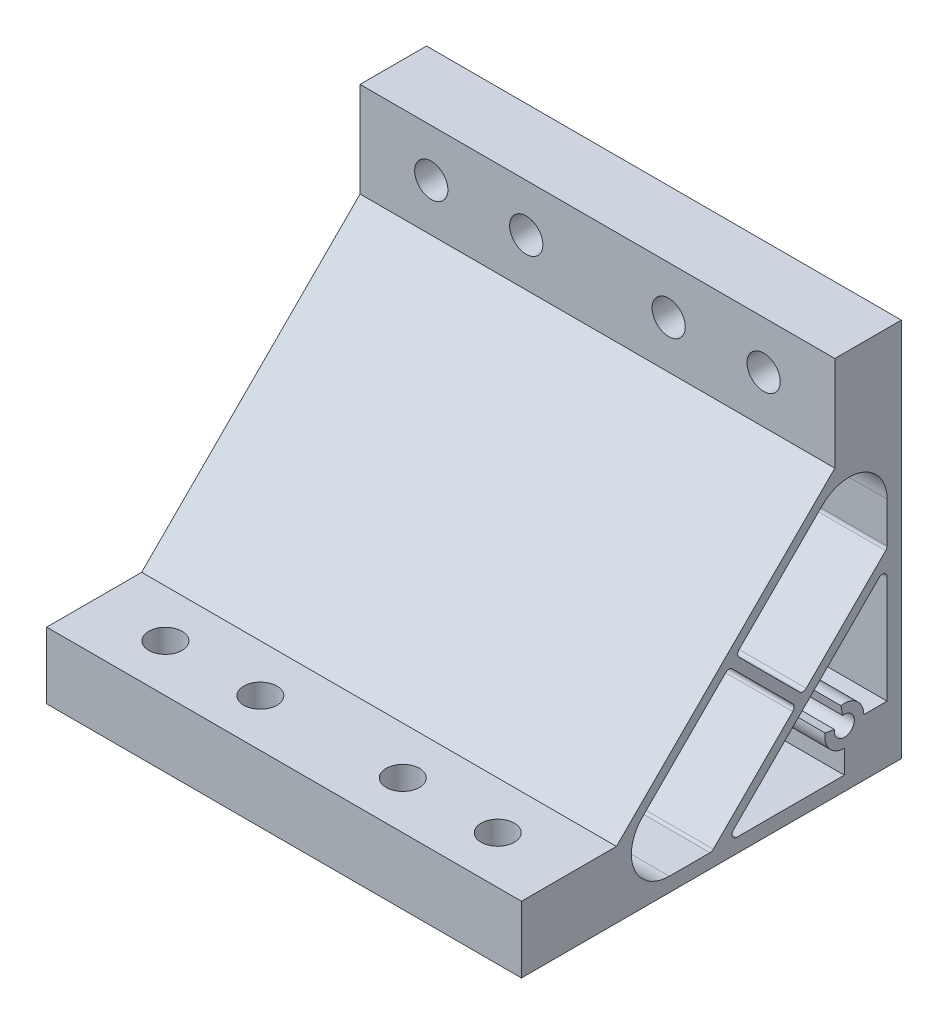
ISO-10303-21;
HEADER;
FILE_DESCRIPTION(('STEP AP214'),'2;1');
FILE_NAME('part.step','',(''),(''),'','','');
FILE_SCHEMA(('AUTOMOTIVE_DESIGN { 1 0 10303 214 1 1 1 1 }'));
ENDSEC;
DATA;
#1=APPLICATION_CONTEXT('core data for automotive mechanical design processes');
#2=APPLICATION_PROTOCOL_DEFINITION('international standard','automotive_design',2000,#1);
#3=PRODUCT_CONTEXT('',#1,'mechanical');
#4=PRODUCT('Part','Part','',(#3));
#5=PRODUCT_RELATED_PRODUCT_CATEGORY('part','',(#4));
#6=PRODUCT_DEFINITION_FORMATION('','',#4);
#7=PRODUCT_DEFINITION_CONTEXT('part definition',#1,'design');
#8=PRODUCT_DEFINITION('design','',#6,#7);
#9=PRODUCT_DEFINITION_SHAPE('','',#8);
#10=(LENGTH_UNIT() NAMED_UNIT(*) SI_UNIT(.MILLI.,.METRE.));
#11=(NAMED_UNIT(*) PLANE_ANGLE_UNIT() SI_UNIT($,.RADIAN.));
#12=(NAMED_UNIT(*) SI_UNIT($,.STERADIAN.) SOLID_ANGLE_UNIT());
#13=UNCERTAINTY_MEASURE_WITH_UNIT(LENGTH_MEASURE(1.E-05),#10,'distance_accuracy_value','');
#14=(GEOMETRIC_REPRESENTATION_CONTEXT(3) GLOBAL_UNCERTAINTY_ASSIGNED_CONTEXT((#13)) GLOBAL_UNIT_ASSIGNED_CONTEXT((#10,
#11,#12)) REPRESENTATION_CONTEXT('',''));
#15=CARTESIAN_POINT('',(0.,0.,0.));
#16=DIRECTION('',(0.,0.,1.));
#17=DIRECTION('',(1.,0.,0.));
#18=AXIS2_PLACEMENT_3D('',#15,#16,#17);
#19=CARTESIAN_POINT('',(50.,0.,0.));
#20=DIRECTION('',(1.,0.,0.));
#21=DIRECTION('',(0.,0.,-1.));
#22=AXIS2_PLACEMENT_3D('',#19,#20,#21);
#23=PLANE('',#22);
#24=DIRECTION('',(0.,0.,1.));
#25=VECTOR('',#24,1.);
#26=CARTESIAN_POINT('',(50.,14.,60.));
#27=LINE('',#26,#25);
#28=CARTESIAN_POINT('',(50.,14.,60.));
#29=VERTEX_POINT('',#28);
#30=CARTESIAN_POINT('',(50.,14.,80.));
#31=VERTEX_POINT('',#30);
#32=EDGE_CURVE('E475',#29,#31,#27,.T.);
#33=ORIENTED_EDGE('',*,*,#32,.T.);
#34=DIRECTION('',(0.,-1.,0.));
#35=VECTOR('',#34,1.);
#36=CARTESIAN_POINT('',(50.,14.,80.));
#37=LINE('',#36,#35);
#38=CARTESIAN_POINT('',(50.,0.,80.));
#39=VERTEX_POINT('',#38);
#40=EDGE_CURVE('E478',#31,#39,#37,.T.);
#41=ORIENTED_EDGE('',*,*,#40,.T.);
#42=DIRECTION('',(0.,0.,-1.));
#43=VECTOR('',#42,1.);
#44=CARTESIAN_POINT('',(50.,0.,80.));
#45=LINE('',#44,#43);
#46=CARTESIAN_POINT('',(50.,0.,0.));
#47=VERTEX_POINT('',#46);
#48=EDGE_CURVE('E480',#39,#47,#45,.T.);
#49=ORIENTED_EDGE('',*,*,#48,.T.);
#50=DIRECTION('',(0.,1.,0.));
#51=VECTOR('',#50,1.);
#52=CARTESIAN_POINT('',(50.,0.,0.));
#53=LINE('',#52,#51);
#54=CARTESIAN_POINT('',(50.,80.,0.));
#55=VERTEX_POINT('',#54);
#56=EDGE_CURVE('E482',#47,#55,#53,.T.);
#57=ORIENTED_EDGE('',*,*,#56,.T.);
#58=DIRECTION('',(0.,0.,1.));
#59=VECTOR('',#58,1.);
#60=CARTESIAN_POINT('',(50.,80.,0.));
#61=LINE('',#60,#59);
#62=CARTESIAN_POINT('',(50.,80.,14.));
#63=VERTEX_POINT('',#62);
#64=EDGE_CURVE('E484',#55,#63,#61,.T.);
#65=ORIENTED_EDGE('',*,*,#64,.T.);
#66=DIRECTION('',(0.,-1.,0.));
#67=VECTOR('',#66,1.);
#68=CARTESIAN_POINT('',(50.,80.,14.));
#69=LINE('',#68,#67);
#70=CARTESIAN_POINT('',(50.,60.,14.));
#71=VERTEX_POINT('',#70);
#72=EDGE_CURVE('E486',#63,#71,#69,.T.);
#73=ORIENTED_EDGE('',*,*,#72,.T.);
#74=DIRECTION('',(0.,-0.707106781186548,0.707106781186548));
#75=VECTOR('',#74,1.);
#76=CARTESIAN_POINT('',(50.,60.,14.));
#77=LINE('',#76,#75);
#78=EDGE_CURVE('E488',#71,#29,#77,.T.);
#79=ORIENTED_EDGE('',*,*,#78,.T.);
#80=EDGE_LOOP('',(#33,#41,#49,#57,#65,#73,#79));
#81=FACE_BOUND('',#80,.T.);
#82=DIRECTION('',(0.,-0.707106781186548,-0.707106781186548));
#83=VECTOR('',#82,1.);
#84=CARTESIAN_POINT('',(50.,35.585786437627,34.171572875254));
#85=LINE('',#84,#83);
#86=CARTESIAN_POINT('',(50.,35.585786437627,34.171572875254));
#87=VERTEX_POINT('',#86);
#88=CARTESIAN_POINT('',(50.,22.857864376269,21.443650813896));
#89=VERTEX_POINT('',#88);
#90=EDGE_CURVE('E444',#87,#89,#85,.T.);
#91=ORIENTED_EDGE('',*,*,#90,.F.);
#92=CARTESIAN_POINT('',(50.,36.2928932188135,33.464466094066));
#93=DIRECTION('',(1.,0.,0.));
#94=DIRECTION('',(0.,0.,-1.));
#95=AXIS2_PLACEMENT_3D('',#92,#93,#94);
#96=CIRCLE('',#95,1.00000000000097);
#97=CARTESIAN_POINT('',(50.,37.,34.171572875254));
#98=VERTEX_POINT('',#97);
#99=EDGE_CURVE('E442',#98,#87,#96,.T.);
#100=ORIENTED_EDGE('',*,*,#99,.F.);
#101=DIRECTION('',(0.,-0.707106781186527,0.707106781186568));
#102=VECTOR('',#101,1.);
#103=CARTESIAN_POINT('',(50.,54.514718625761,16.656854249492));
#104=LINE('',#103,#102);
#105=CARTESIAN_POINT('',(50.,54.514718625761,16.656854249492));
#106=VERTEX_POINT('',#105);
#107=EDGE_CURVE('E457',#106,#98,#104,.T.);
#108=ORIENTED_EDGE('',*,*,#107,.F.);
#109=CARTESIAN_POINT('',(50.,48.8578643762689,10.9999999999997));
#110=DIRECTION('',(1.,0.,0.));
#111=DIRECTION('',(0.,0.,-1.));
#112=AXIS2_PLACEMENT_3D('',#109,#110,#111);
#113=CIRCLE('',#112,7.99999999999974);
#114=CARTESIAN_POINT('',(50.,48.857864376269,3.));
#115=VERTEX_POINT('',#114);
#116=EDGE_CURVE('E454',#115,#106,#113,.T.);
#117=ORIENTED_EDGE('',*,*,#116,.F.);
#118=DIRECTION('',(0.,1.,0.));
#119=VECTOR('',#118,1.);
#120=CARTESIAN_POINT('',(50.,40.301515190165,3.));
#121=LINE('',#120,#119);
#122=CARTESIAN_POINT('',(50.,40.301515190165,3.));
#123=VERTEX_POINT('',#122);
#124=EDGE_CURVE('E452',#123,#115,#121,.T.);
#125=ORIENTED_EDGE('',*,*,#124,.F.);
#126=CARTESIAN_POINT('',(50.,40.3015151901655,4.00000000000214));
#127=DIRECTION('',(1.,0.,0.));
#128=DIRECTION('',(0.,0.,-1.));
#129=AXIS2_PLACEMENT_3D('',#126,#127,#128);
#130=CIRCLE('',#129,1.00000000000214);
#131=CARTESIAN_POINT('',(50.,39.594408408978,3.2928932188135));
#132=VERTEX_POINT('',#131);
#133=EDGE_CURVE('E450',#132,#123,#130,.T.);
#134=ORIENTED_EDGE('',*,*,#133,.F.);
#135=DIRECTION('',(0.,0.707106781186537,-0.707106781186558));
#136=VECTOR('',#135,1.);
#137=CARTESIAN_POINT('',(50.,22.857864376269,20.029437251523));
#138=LINE('',#137,#136);
#139=CARTESIAN_POINT('',(50.,22.857864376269,20.029437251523));
#140=VERTEX_POINT('',#139);
#141=EDGE_CURVE('E448',#140,#132,#138,.T.);
#142=ORIENTED_EDGE('',*,*,#141,.F.);
#143=CARTESIAN_POINT('',(50.,23.564971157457,20.7365440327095));
#144=DIRECTION('',(1.,0.,0.));
#145=DIRECTION('',(0.,0.,-1.));
#146=AXIS2_PLACEMENT_3D('',#143,#144,#145);
#147=CIRCLE('',#146,1.00000000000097);
#148=EDGE_CURVE('E446',#89,#140,#147,.T.);
#149=ORIENTED_EDGE('',*,*,#148,.F.);
#150=EDGE_LOOP('',(#91,#100,#108,#117,#125,#134,#142,#149));
#151=FACE_BOUND('',#150,.T.);
#152=DIRECTION('',(0.,0.,-1.));
#153=VECTOR('',#152,1.);
#154=CARTESIAN_POINT('',(50.,3.,34.644660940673));
#155=LINE('',#154,#153);
#156=CARTESIAN_POINT('',(50.,3.,34.644660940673));
#157=VERTEX_POINT('',#156);
#158=CARTESIAN_POINT('',(50.,3.,12.));
#159=VERTEX_POINT('',#158);
#160=EDGE_CURVE('E397',#157,#159,#155,.T.);
#161=ORIENTED_EDGE('',*,*,#160,.F.);
#162=CARTESIAN_POINT('',(50.,3.99999999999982,34.6446609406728));
#163=DIRECTION('',(1.,0.,0.));
#164=DIRECTION('',(0.,0.,-1.));
#165=AXIS2_PLACEMENT_3D('',#162,#163,#164);
#166=CIRCLE('',#165,0.999999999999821);
#167=CARTESIAN_POINT('',(50.,4.7071067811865,35.351767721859));
#168=VERTEX_POINT('',#167);
#169=EDGE_CURVE('E252',#168,#157,#166,.T.);
#170=ORIENTED_EDGE('',*,*,#169,.F.);
#171=DIRECTION('',(0.,-0.707106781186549,0.707106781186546));
#172=VECTOR('',#171,1.);
#173=CARTESIAN_POINT('',(50.,35.351767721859,4.7071067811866));
#174=LINE('',#173,#172);
#175=CARTESIAN_POINT('',(50.,35.351767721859,4.7071067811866));
#176=VERTEX_POINT('',#175);
#177=EDGE_CURVE('E417',#176,#168,#174,.T.);
#178=ORIENTED_EDGE('',*,*,#177,.F.);
#179=CARTESIAN_POINT('',(50.,34.6446609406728,3.99999999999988));
#180=DIRECTION('',(1.,0.,0.));
#181=DIRECTION('',(0.,0.,-1.));
#182=AXIS2_PLACEMENT_3D('',#179,#180,#181);
#183=CIRCLE('',#182,0.999999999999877);
#184=CARTESIAN_POINT('',(50.,34.644660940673,3.));
#185=VERTEX_POINT('',#184);
#186=EDGE_CURVE('E415',#185,#176,#183,.T.);
#187=ORIENTED_EDGE('',*,*,#186,.F.);
#188=DIRECTION('',(0.,1.,0.));
#189=VECTOR('',#188,1.);
#190=CARTESIAN_POINT('',(50.,12.,3.));
#191=LINE('',#190,#189);
#192=CARTESIAN_POINT('',(50.,12.,3.));
#193=VERTEX_POINT('',#192);
#194=EDGE_CURVE('E413',#193,#185,#191,.T.);
#195=ORIENTED_EDGE('',*,*,#194,.F.);
#196=DIRECTION('',(0.,0.,-1.));
#197=VECTOR('',#196,1.);
#198=CARTESIAN_POINT('',(50.,12.,7.9));
#199=LINE('',#198,#197);
#200=CARTESIAN_POINT('',(50.,12.,7.9));
#201=VERTEX_POINT('',#200);
#202=EDGE_CURVE('E411',#201,#193,#199,.T.);
#203=ORIENTED_EDGE('',*,*,#202,.F.);
#204=CARTESIAN_POINT('',(50.,11.9999999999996,12.0000000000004));
#205=DIRECTION('',(-1.,0.,0.));
#206=DIRECTION('',(0.,0.,1.));
#207=AXIS2_PLACEMENT_3D('',#204,#205,#206);
#208=CIRCLE('',#207,4.1000000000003);
#209=CARTESIAN_POINT('',(50.,16.0377117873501,12.711957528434));
#210=VERTEX_POINT('',#209);
#211=EDGE_CURVE('E409',#210,#201,#208,.T.);
#212=ORIENTED_EDGE('',*,*,#211,.F.);
#213=DIRECTION('',(0.,0.984807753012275,0.173648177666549));
#214=VECTOR('',#213,1.);
#215=CARTESIAN_POINT('',(50.,14.068096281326,12.364661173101));
#216=LINE('',#215,#214);
#217=CARTESIAN_POINT('',(50.,14.068096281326,12.364661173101));
#218=VERTEX_POINT('',#217);
#219=EDGE_CURVE('E407',#218,#210,#216,.T.);
#220=ORIENTED_EDGE('',*,*,#219,.F.);
#221=CARTESIAN_POINT('',(50.,11.9999999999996,12.0000000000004));
#222=DIRECTION('',(1.,0.,0.));
#223=DIRECTION('',(0.,0.,-1.));
#224=AXIS2_PLACEMENT_3D('',#221,#222,#223);
#225=CIRCLE('',#224,2.10000000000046);
#226=CARTESIAN_POINT('',(50.,12.3646611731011,14.0680962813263));
#227=VERTEX_POINT('',#226);
#228=EDGE_CURVE('E405',#227,#218,#225,.T.);
#229=ORIENTED_EDGE('',*,*,#228,.F.);
#230=DIRECTION('',(0.,-0.173648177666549,-0.984807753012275));
#231=VECTOR('',#230,1.);
#232=CARTESIAN_POINT('',(50.,12.711957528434,16.03771178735));
#233=LINE('',#232,#231);
#234=CARTESIAN_POINT('',(50.,12.711957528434,16.03771178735));
#235=VERTEX_POINT('',#234);
#236=EDGE_CURVE('E403',#235,#227,#233,.T.);
#237=ORIENTED_EDGE('',*,*,#236,.F.);
#238=CARTESIAN_POINT('',(50.,11.9999999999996,12.0000000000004));
#239=DIRECTION('',(-1.,0.,0.));
#240=DIRECTION('',(0.,0.,1.));
#241=AXIS2_PLACEMENT_3D('',#238,#239,#240);
#242=CIRCLE('',#241,4.09999999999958);
#243=CARTESIAN_POINT('',(50.,7.9,12.));
#244=VERTEX_POINT('',#243);
#245=EDGE_CURVE('E401',#244,#235,#242,.T.);
#246=ORIENTED_EDGE('',*,*,#245,.F.);
#247=DIRECTION('',(0.,1.,0.));
#248=VECTOR('',#247,1.);
#249=CARTESIAN_POINT('',(50.,3.,12.));
#250=LINE('',#249,#248);
#251=EDGE_CURVE('E399',#159,#244,#250,.T.);
#252=ORIENTED_EDGE('',*,*,#251,.F.);
#253=EDGE_LOOP('',(#161,#170,#178,#187,#195,#203,#212,#220,#229,#237,#246,#252));
#254=FACE_BOUND('',#253,.T.);
#255=DIRECTION('',(0.,0.,-1.));
#256=VECTOR('',#255,1.);
#257=CARTESIAN_POINT('',(50.,3.,48.857864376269));
#258=LINE('',#257,#256);
#259=CARTESIAN_POINT('',(50.,3.,48.857864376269));
#260=VERTEX_POINT('',#259);
#261=CARTESIAN_POINT('',(50.,3.,40.301515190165));
#262=VERTEX_POINT('',#261);
#263=EDGE_CURVE('E370',#260,#262,#258,.T.);
#264=ORIENTED_EDGE('',*,*,#263,.F.);
#265=CARTESIAN_POINT('',(50.,10.9999999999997,48.8578643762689));
#266=DIRECTION('',(1.,0.,0.));
#267=DIRECTION('',(0.,0.,-1.));
#268=AXIS2_PLACEMENT_3D('',#265,#266,#267);
#269=CIRCLE('',#268,7.99999999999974);
#270=CARTESIAN_POINT('',(50.,16.656854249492,54.514718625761));
#271=VERTEX_POINT('',#270);
#272=EDGE_CURVE('E249',#271,#260,#269,.T.);
#273=ORIENTED_EDGE('',*,*,#272,.F.);
#274=DIRECTION('',(0.,-0.707106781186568,0.707106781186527));
#275=VECTOR('',#274,1.);
#276=CARTESIAN_POINT('',(50.,34.171572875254,37.));
#277=LINE('',#276,#275);
#278=CARTESIAN_POINT('',(50.,34.171572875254,37.));
#279=VERTEX_POINT('',#278);
#280=EDGE_CURVE('E382',#279,#271,#277,.T.);
#281=ORIENTED_EDGE('',*,*,#280,.F.);
#282=CARTESIAN_POINT('',(50.,33.464466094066,36.2928932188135));
#283=DIRECTION('',(1.,0.,0.));
#284=DIRECTION('',(0.,0.,-1.));
#285=AXIS2_PLACEMENT_3D('',#282,#283,#284);
#286=CIRCLE('',#285,1.00000000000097);
#287=CARTESIAN_POINT('',(50.,34.171572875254,35.585786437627));
#288=VERTEX_POINT('',#287);
#289=EDGE_CURVE('E380',#288,#279,#286,.T.);
#290=ORIENTED_EDGE('',*,*,#289,.F.);
#291=DIRECTION('',(0.,0.707106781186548,0.707106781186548));
#292=VECTOR('',#291,1.);
#293=CARTESIAN_POINT('',(50.,21.443650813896,22.857864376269));
#294=LINE('',#293,#292);
#295=CARTESIAN_POINT('',(50.,21.443650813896,22.857864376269));
#296=VERTEX_POINT('',#295);
#297=EDGE_CURVE('E378',#296,#288,#294,.T.);
#298=ORIENTED_EDGE('',*,*,#297,.F.);
#299=CARTESIAN_POINT('',(50.,20.7365440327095,23.564971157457));
#300=DIRECTION('',(1.,0.,0.));
#301=DIRECTION('',(0.,0.,-1.));
#302=AXIS2_PLACEMENT_3D('',#299,#300,#301);
#303=CIRCLE('',#302,1.00000000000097);
#304=CARTESIAN_POINT('',(50.,20.029437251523,22.857864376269));
#305=VERTEX_POINT('',#304);
#306=EDGE_CURVE('E376',#305,#296,#303,.T.);
#307=ORIENTED_EDGE('',*,*,#306,.F.);
#308=DIRECTION('',(0.,0.707106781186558,-0.707106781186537));
#309=VECTOR('',#308,1.);
#310=CARTESIAN_POINT('',(50.,3.2928932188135,39.594408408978));
#311=LINE('',#310,#309);
#312=CARTESIAN_POINT('',(50.,3.2928932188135,39.594408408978));
#313=VERTEX_POINT('',#312);
#314=EDGE_CURVE('E374',#313,#305,#311,.T.);
#315=ORIENTED_EDGE('',*,*,#314,.F.);
#316=CARTESIAN_POINT('',(50.,4.00000000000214,40.3015151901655));
#317=DIRECTION('',(1.,0.,0.));
#318=DIRECTION('',(0.,0.,-1.));
#319=AXIS2_PLACEMENT_3D('',#316,#317,#318);
#320=CIRCLE('',#319,1.00000000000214);
#321=EDGE_CURVE('E372',#262,#313,#320,.T.);
#322=ORIENTED_EDGE('',*,*,#321,.F.);
#323=EDGE_LOOP('',(#264,#273,#281,#290,#298,#307,#315,#322));
#324=FACE_BOUND('',#323,.T.);
#325=ADVANCED_FACE('F15',(#81,#151,#254,#324),#23,.T.);
#326=CARTESIAN_POINT('',(50.,14.,60.));
#327=DIRECTION('',(0.,-1.,0.));
#328=DIRECTION('',(0.,0.,-1.));
#329=AXIS2_PLACEMENT_3D('',#326,#327,#328);
#330=PLANE('',#329);
#331=CARTESIAN_POINT('',(35.,14.,70.));
#332=DIRECTION('',(0.,1.,0.));
#333=DIRECTION('',(0.,0.,1.));
#334=AXIS2_PLACEMENT_3D('',#331,#332,#333);
#335=CIRCLE('',#334,3.5);
#336=CARTESIAN_POINT('',(35.,14.,73.5));
#337=VERTEX_POINT('',#336);
#338=EDGE_CURVE('E698',#337,#337,#335,.T.);
#339=ORIENTED_EDGE('',*,*,#338,.F.);
#340=EDGE_LOOP('',(#339));
#341=FACE_BOUND('',#340,.T.);
#342=CARTESIAN_POINT('',(15.,14.,70.));
#343=DIRECTION('',(0.,1.,0.));
#344=DIRECTION('',(0.,0.,1.));
#345=AXIS2_PLACEMENT_3D('',#342,#343,#344);
#346=CIRCLE('',#345,3.5);
#347=CARTESIAN_POINT('',(15.,14.,73.5));
#348=VERTEX_POINT('',#347);
#349=EDGE_CURVE('E702',#348,#348,#346,.T.);
#350=ORIENTED_EDGE('',*,*,#349,.F.);
#351=EDGE_LOOP('',(#350));
#352=FACE_BOUND('',#351,.T.);
#353=CARTESIAN_POINT('',(-15.,14.,70.));
#354=DIRECTION('',(0.,1.,0.));
#355=DIRECTION('',(0.,0.,1.));
#356=AXIS2_PLACEMENT_3D('',#353,#354,#355);
#357=CIRCLE('',#356,3.5);
#358=CARTESIAN_POINT('',(-15.,14.,73.5));
#359=VERTEX_POINT('',#358);
#360=EDGE_CURVE('E706',#359,#359,#357,.T.);
#361=ORIENTED_EDGE('',*,*,#360,.F.);
#362=EDGE_LOOP('',(#361));
#363=FACE_BOUND('',#362,.T.);
#364=CARTESIAN_POINT('',(-35.,14.,70.));
#365=DIRECTION('',(0.,1.,0.));
#366=DIRECTION('',(0.,0.,1.));
#367=AXIS2_PLACEMENT_3D('',#364,#365,#366);
#368=CIRCLE('',#367,3.5);
#369=CARTESIAN_POINT('',(-35.,14.,73.5));
#370=VERTEX_POINT('',#369);
#371=EDGE_CURVE('E268',#370,#370,#368,.T.);
#372=ORIENTED_EDGE('',*,*,#371,.F.);
#373=EDGE_LOOP('',(#372));
#374=FACE_BOUND('',#373,.T.);
#375=DIRECTION('',(-1.,0.,0.));
#376=VECTOR('',#375,1.);
#377=CARTESIAN_POINT('',(50.,14.,60.));
#378=LINE('',#377,#376);
#379=CARTESIAN_POINT('',(-50.,14.,60.));
#380=VERTEX_POINT('',#379);
#381=EDGE_CURVE('E490',#29,#380,#378,.T.);
#382=ORIENTED_EDGE('',*,*,#381,.T.);
#383=DIRECTION('',(0.,0.,1.));
#384=VECTOR('',#383,1.);
#385=CARTESIAN_POINT('',(-50.,14.,60.));
#386=LINE('',#385,#384);
#387=CARTESIAN_POINT('',(-50.,14.,80.));
#388=VERTEX_POINT('',#387);
#389=EDGE_CURVE('E348',#380,#388,#386,.T.);
#390=ORIENTED_EDGE('',*,*,#389,.T.);
#391=DIRECTION('',(-1.,0.,0.));
#392=VECTOR('',#391,1.);
#393=CARTESIAN_POINT('',(50.,14.,80.));
#394=LINE('',#393,#392);
#395=EDGE_CURVE('E9',#31,#388,#394,.T.);
#396=ORIENTED_EDGE('',*,*,#395,.F.);
#397=ORIENTED_EDGE('',*,*,#32,.F.);
#398=EDGE_LOOP('',(#382,#390,#396,#397));
#399=FACE_BOUND('',#398,.T.);
#400=ADVANCED_FACE('F17',(#341,#352,#363,#374,#399),#330,.F.);
#401=CARTESIAN_POINT('',(50.,14.,80.));
#402=DIRECTION('',(0.,0.,-1.));
#403=DIRECTION('',(-1.,0.,0.));
#404=AXIS2_PLACEMENT_3D('',#401,#402,#403);
#405=PLANE('',#404);
#406=ORIENTED_EDGE('',*,*,#395,.T.);
#407=DIRECTION('',(0.,-1.,0.));
#408=VECTOR('',#407,1.);
#409=CARTESIAN_POINT('',(-50.,14.,80.));
#410=LINE('',#409,#408);
#411=CARTESIAN_POINT('',(-50.,0.,80.));
#412=VERTEX_POINT('',#411);
#413=EDGE_CURVE('E351',#388,#412,#410,.T.);
#414=ORIENTED_EDGE('',*,*,#413,.T.);
#415=DIRECTION('',(-1.,0.,0.));
#416=VECTOR('',#415,1.);
#417=CARTESIAN_POINT('',(50.,0.,80.));
#418=LINE('',#417,#416);
#419=EDGE_CURVE('E23',#39,#412,#418,.T.);
#420=ORIENTED_EDGE('',*,*,#419,.F.);
#421=ORIENTED_EDGE('',*,*,#40,.F.);
#422=EDGE_LOOP('',(#406,#414,#420,#421));
#423=FACE_BOUND('',#422,.T.);
#424=ADVANCED_FACE('F511',(#423),#405,.F.);
#425=CARTESIAN_POINT('',(50.,0.,80.));
#426=DIRECTION('',(0.,1.,0.));
#427=DIRECTION('',(0.,0.,1.));
#428=AXIS2_PLACEMENT_3D('',#425,#426,#427);
#429=PLANE('',#428);
#430=CARTESIAN_POINT('',(35.,0.,70.));
#431=DIRECTION('',(0.,1.,0.));
#432=DIRECTION('',(0.,0.,1.));
#433=AXIS2_PLACEMENT_3D('',#430,#431,#432);
#434=CIRCLE('',#433,3.5);
#435=CARTESIAN_POINT('',(35.,0.,73.5));
#436=VERTEX_POINT('',#435);
#437=EDGE_CURVE('E725',#436,#436,#434,.T.);
#438=ORIENTED_EDGE('',*,*,#437,.T.);
#439=EDGE_LOOP('',(#438));
#440=FACE_BOUND('',#439,.T.);
#441=CARTESIAN_POINT('',(15.,0.,70.));
#442=DIRECTION('',(0.,1.,0.));
#443=DIRECTION('',(0.,0.,1.));
#444=AXIS2_PLACEMENT_3D('',#441,#442,#443);
#445=CIRCLE('',#444,3.5);
#446=CARTESIAN_POINT('',(15.,0.,73.5));
#447=VERTEX_POINT('',#446);
#448=EDGE_CURVE('E721',#447,#447,#445,.T.);
#449=ORIENTED_EDGE('',*,*,#448,.T.);
#450=EDGE_LOOP('',(#449));
#451=FACE_BOUND('',#450,.T.);
#452=CARTESIAN_POINT('',(-15.,0.,70.));
#453=DIRECTION('',(0.,1.,0.));
#454=DIRECTION('',(0.,0.,1.));
#455=AXIS2_PLACEMENT_3D('',#452,#453,#454);
#456=CIRCLE('',#455,3.5);
#457=CARTESIAN_POINT('',(-15.,0.,73.5));
#458=VERTEX_POINT('',#457);
#459=EDGE_CURVE('E715',#458,#458,#456,.T.);
#460=ORIENTED_EDGE('',*,*,#459,.T.);
#461=EDGE_LOOP('',(#460));
#462=FACE_BOUND('',#461,.T.);
#463=CARTESIAN_POINT('',(-35.,0.,70.));
#464=DIRECTION('',(0.,1.,0.));
#465=DIRECTION('',(0.,0.,1.));
#466=AXIS2_PLACEMENT_3D('',#463,#464,#465);
#467=CIRCLE('',#466,3.5);
#468=CARTESIAN_POINT('',(-35.,0.,73.5));
#469=VERTEX_POINT('',#468);
#470=EDGE_CURVE('E271',#469,#469,#467,.T.);
#471=ORIENTED_EDGE('',*,*,#470,.T.);
#472=EDGE_LOOP('',(#471));
#473=FACE_BOUND('',#472,.T.);
#474=ORIENTED_EDGE('',*,*,#419,.T.);
#475=DIRECTION('',(0.,0.,-1.));
#476=VECTOR('',#475,1.);
#477=CARTESIAN_POINT('',(-50.,0.,80.));
#478=LINE('',#477,#476);
#479=CARTESIAN_POINT('',(-50.,0.,0.));
#480=VERTEX_POINT('',#479);
#481=EDGE_CURVE('E354',#412,#480,#478,.T.);
#482=ORIENTED_EDGE('',*,*,#481,.T.);
#483=DIRECTION('',(-1.,0.,0.));
#484=VECTOR('',#483,1.);
#485=CARTESIAN_POINT('',(50.,0.,0.));
#486=LINE('',#485,#484);
#487=EDGE_CURVE('E498',#47,#480,#486,.T.);
#488=ORIENTED_EDGE('',*,*,#487,.F.);
#489=ORIENTED_EDGE('',*,*,#48,.F.);
#490=EDGE_LOOP('',(#474,#482,#488,#489));
#491=FACE_BOUND('',#490,.T.);
#492=ADVANCED_FACE('F503',(#440,#451,#462,#473,#491),#429,.F.);
#493=CARTESIAN_POINT('',(50.,0.,0.));
#494=DIRECTION('',(0.,0.,1.));
#495=DIRECTION('',(1.,0.,0.));
#496=AXIS2_PLACEMENT_3D('',#493,#494,#495);
#497=PLANE('',#496);
#498=CARTESIAN_POINT('',(35.,70.,0.));
#499=DIRECTION('',(0.,0.,1.));
#500=DIRECTION('',(1.,0.,0.));
#501=AXIS2_PLACEMENT_3D('',#498,#499,#500);
#502=CIRCLE('',#501,3.5);
#503=CARTESIAN_POINT('',(38.5,70.,0.));
#504=VERTEX_POINT('',#503);
#505=EDGE_CURVE('E748',#504,#504,#502,.T.);
#506=ORIENTED_EDGE('',*,*,#505,.T.);
#507=EDGE_LOOP('',(#506));
#508=FACE_BOUND('',#507,.T.);
#509=CARTESIAN_POINT('',(15.,70.,0.));
#510=DIRECTION('',(0.,0.,1.));
#511=DIRECTION('',(1.,0.,0.));
#512=AXIS2_PLACEMENT_3D('',#509,#510,#511);
#513=CIRCLE('',#512,3.5);
#514=CARTESIAN_POINT('',(18.5,70.,0.));
#515=VERTEX_POINT('',#514);
#516=EDGE_CURVE('E742',#515,#515,#513,.T.);
#517=ORIENTED_EDGE('',*,*,#516,.T.);
#518=EDGE_LOOP('',(#517));
#519=FACE_BOUND('',#518,.T.);
#520=CARTESIAN_POINT('',(-15.,70.,0.));
#521=DIRECTION('',(0.,0.,1.));
#522=DIRECTION('',(1.,0.,0.));
#523=AXIS2_PLACEMENT_3D('',#520,#521,#522);
#524=CIRCLE('',#523,3.5);
#525=CARTESIAN_POINT('',(-11.5,70.,0.));
#526=VERTEX_POINT('',#525);
#527=EDGE_CURVE('E736',#526,#526,#524,.T.);
#528=ORIENTED_EDGE('',*,*,#527,.T.);
#529=EDGE_LOOP('',(#528));
#530=FACE_BOUND('',#529,.T.);
#531=CARTESIAN_POINT('',(-35.,70.,0.));
#532=DIRECTION('',(0.,0.,1.));
#533=DIRECTION('',(1.,0.,0.));
#534=AXIS2_PLACEMENT_3D('',#531,#532,#533);
#535=CIRCLE('',#534,3.5);
#536=CARTESIAN_POINT('',(-31.5,70.,0.));
#537=VERTEX_POINT('',#536);
#538=EDGE_CURVE('E730',#537,#537,#535,.T.);
#539=ORIENTED_EDGE('',*,*,#538,.T.);
#540=EDGE_LOOP('',(#539));
#541=FACE_BOUND('',#540,.T.);
#542=ORIENTED_EDGE('',*,*,#487,.T.);
#543=DIRECTION('',(0.,1.,0.));
#544=VECTOR('',#543,1.);
#545=CARTESIAN_POINT('',(-50.,0.,0.));
#546=LINE('',#545,#544);
#547=CARTESIAN_POINT('',(-50.,80.,0.));
#548=VERTEX_POINT('',#547);
#549=EDGE_CURVE('E357',#480,#548,#546,.T.);
#550=ORIENTED_EDGE('',*,*,#549,.T.);
#551=DIRECTION('',(-1.,0.,0.));
#552=VECTOR('',#551,1.);
#553=CARTESIAN_POINT('',(50.,80.,0.));
#554=LINE('',#553,#552);
#555=EDGE_CURVE('E496',#55,#548,#554,.T.);
#556=ORIENTED_EDGE('',*,*,#555,.F.);
#557=ORIENTED_EDGE('',*,*,#56,.F.);
#558=EDGE_LOOP('',(#542,#550,#556,#557));
#559=FACE_BOUND('',#558,.T.);
#560=ADVANCED_FACE('F532',(#508,#519,#530,#541,#559),#497,.F.);
#561=CARTESIAN_POINT('',(50.,80.,0.));
#562=DIRECTION('',(0.,-1.,0.));
#563=DIRECTION('',(0.,0.,-1.));
#564=AXIS2_PLACEMENT_3D('',#561,#562,#563);
#565=PLANE('',#564);
#566=ORIENTED_EDGE('',*,*,#555,.T.);
#567=DIRECTION('',(0.,0.,1.));
#568=VECTOR('',#567,1.);
#569=CARTESIAN_POINT('',(-50.,80.,0.));
#570=LINE('',#569,#568);
#571=CARTESIAN_POINT('',(-50.,80.,14.));
#572=VERTEX_POINT('',#571);
#573=EDGE_CURVE('E360',#548,#572,#570,.T.);
#574=ORIENTED_EDGE('',*,*,#573,.T.);
#575=DIRECTION('',(-1.,0.,0.));
#576=VECTOR('',#575,1.);
#577=CARTESIAN_POINT('',(50.,80.,14.));
#578=LINE('',#577,#576);
#579=EDGE_CURVE('E494',#63,#572,#578,.T.);
#580=ORIENTED_EDGE('',*,*,#579,.F.);
#581=ORIENTED_EDGE('',*,*,#64,.F.);
#582=EDGE_LOOP('',(#566,#574,#580,#581));
#583=FACE_BOUND('',#582,.T.);
#584=ADVANCED_FACE('F527',(#583),#565,.F.);
#585=CARTESIAN_POINT('',(50.,80.,14.));
#586=DIRECTION('',(0.,0.,-1.));
#587=DIRECTION('',(-1.,0.,0.));
#588=AXIS2_PLACEMENT_3D('',#585,#586,#587);
#589=PLANE('',#588);
#590=CARTESIAN_POINT('',(35.,70.,14.));
#591=DIRECTION('',(0.,0.,1.));
#592=DIRECTION('',(1.,0.,0.));
#593=AXIS2_PLACEMENT_3D('',#590,#591,#592);
#594=CIRCLE('',#593,3.5);
#595=CARTESIAN_POINT('',(38.5,70.,14.));
#596=VERTEX_POINT('',#595);
#597=EDGE_CURVE('E745',#596,#596,#594,.T.);
#598=ORIENTED_EDGE('',*,*,#597,.F.);
#599=EDGE_LOOP('',(#598));
#600=FACE_BOUND('',#599,.T.);
#601=CARTESIAN_POINT('',(15.,70.,14.));
#602=DIRECTION('',(0.,0.,1.));
#603=DIRECTION('',(1.,0.,0.));
#604=AXIS2_PLACEMENT_3D('',#601,#602,#603);
#605=CIRCLE('',#604,3.5);
#606=CARTESIAN_POINT('',(18.5,70.,14.));
#607=VERTEX_POINT('',#606);
#608=EDGE_CURVE('E739',#607,#607,#605,.T.);
#609=ORIENTED_EDGE('',*,*,#608,.F.);
#610=EDGE_LOOP('',(#609));
#611=FACE_BOUND('',#610,.T.);
#612=CARTESIAN_POINT('',(-15.,70.,14.));
#613=DIRECTION('',(0.,0.,1.));
#614=DIRECTION('',(1.,0.,0.));
#615=AXIS2_PLACEMENT_3D('',#612,#613,#614);
#616=CIRCLE('',#615,3.5);
#617=CARTESIAN_POINT('',(-11.5,70.,14.));
#618=VERTEX_POINT('',#617);
#619=EDGE_CURVE('E733',#618,#618,#616,.T.);
#620=ORIENTED_EDGE('',*,*,#619,.F.);
#621=EDGE_LOOP('',(#620));
#622=FACE_BOUND('',#621,.T.);
#623=CARTESIAN_POINT('',(-35.,70.,14.));
#624=DIRECTION('',(0.,0.,1.));
#625=DIRECTION('',(1.,0.,0.));
#626=AXIS2_PLACEMENT_3D('',#623,#624,#625);
#627=CIRCLE('',#626,3.5);
#628=CARTESIAN_POINT('',(-31.5,70.,14.));
#629=VERTEX_POINT('',#628);
#630=EDGE_CURVE('E728',#629,#629,#627,.T.);
#631=ORIENTED_EDGE('',*,*,#630,.F.);
#632=EDGE_LOOP('',(#631));
#633=FACE_BOUND('',#632,.T.);
#634=ORIENTED_EDGE('',*,*,#579,.T.);
#635=DIRECTION('',(0.,-1.,0.));
#636=VECTOR('',#635,1.);
#637=CARTESIAN_POINT('',(-50.,80.,14.));
#638=LINE('',#637,#636);
#639=CARTESIAN_POINT('',(-50.,60.,14.));
#640=VERTEX_POINT('',#639);
#641=EDGE_CURVE('E363',#572,#640,#638,.T.);
#642=ORIENTED_EDGE('',*,*,#641,.T.);
#643=DIRECTION('',(-1.,0.,0.));
#644=VECTOR('',#643,1.);
#645=CARTESIAN_POINT('',(50.,60.,14.));
#646=LINE('',#645,#644);
#647=EDGE_CURVE('E492',#71,#640,#646,.T.);
#648=ORIENTED_EDGE('',*,*,#647,.F.);
#649=ORIENTED_EDGE('',*,*,#72,.F.);
#650=EDGE_LOOP('',(#634,#642,#648,#649));
#651=FACE_BOUND('',#650,.T.);
#652=ADVANCED_FACE('F524',(#600,#611,#622,#633,#651),#589,.F.);
#653=CARTESIAN_POINT('',(50.,60.,14.));
#654=DIRECTION('',(0.,-0.707106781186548,-0.707106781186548));
#655=DIRECTION('',(0.,0.707106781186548,-0.707106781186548));
#656=AXIS2_PLACEMENT_3D('',#653,#654,#655);
#657=PLANE('',#656);
#658=ORIENTED_EDGE('',*,*,#647,.T.);
#659=DIRECTION('',(0.,-0.707106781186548,0.707106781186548));
#660=VECTOR('',#659,1.);
#661=CARTESIAN_POINT('',(-50.,60.,14.));
#662=LINE('',#661,#660);
#663=EDGE_CURVE('E366',#640,#380,#662,.T.);
#664=ORIENTED_EDGE('',*,*,#663,.T.);
#665=ORIENTED_EDGE('',*,*,#381,.F.);
#666=ORIENTED_EDGE('',*,*,#78,.F.);
#667=EDGE_LOOP('',(#658,#664,#665,#666));
#668=FACE_BOUND('',#667,.T.);
#669=ADVANCED_FACE('F519',(#668),#657,.F.);
#670=CARTESIAN_POINT('',(50.,36.2928932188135,33.464466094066));
#671=DIRECTION('',(-1.,0.,0.));
#672=DIRECTION('',(0.,0.,1.));
#673=AXIS2_PLACEMENT_3D('',#670,#671,#672);
#674=CYLINDRICAL_SURFACE('',#673,1.00000000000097);
#675=DIRECTION('',(-1.,0.,0.));
#676=VECTOR('',#675,1.);
#677=CARTESIAN_POINT('',(50.,35.585786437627,34.171572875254));
#678=LINE('',#677,#676);
#679=CARTESIAN_POINT('',(-50.,35.585786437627,34.171572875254));
#680=VERTEX_POINT('',#679);
#681=EDGE_CURVE('E473',#87,#680,#678,.T.);
#682=ORIENTED_EDGE('',*,*,#681,.T.);
#683=CARTESIAN_POINT('',(-50.,36.2928932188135,33.464466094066));
#684=DIRECTION('',(1.,0.,0.));
#685=DIRECTION('',(0.,0.,-1.));
#686=AXIS2_PLACEMENT_3D('',#683,#684,#685);
#687=CIRCLE('',#686,1.00000000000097);
#688=CARTESIAN_POINT('',(-50.,37.,34.171572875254));
#689=VERTEX_POINT('',#688);
#690=EDGE_CURVE('E324',#689,#680,#687,.T.);
#691=ORIENTED_EDGE('',*,*,#690,.F.);
#692=DIRECTION('',(-1.,0.,0.));
#693=VECTOR('',#692,1.);
#694=CARTESIAN_POINT('',(50.,37.,34.171572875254));
#695=LINE('',#694,#693);
#696=EDGE_CURVE('E459',#98,#689,#695,.T.);
#697=ORIENTED_EDGE('',*,*,#696,.F.);
#698=ORIENTED_EDGE('',*,*,#99,.T.);
#699=EDGE_LOOP('',(#682,#691,#697,#698));
#700=FACE_BOUND('',#699,.T.);
#701=ADVANCED_FACE('F669',(#700),#674,.F.);
#702=CARTESIAN_POINT('',(50.,35.585786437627,34.171572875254));
#703=DIRECTION('',(0.,0.707106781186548,-0.707106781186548));
#704=DIRECTION('',(0.,0.707106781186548,0.707106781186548));
#705=AXIS2_PLACEMENT_3D('',#702,#703,#704);
#706=PLANE('',#705);
#707=DIRECTION('',(-1.,0.,0.));
#708=VECTOR('',#707,1.);
#709=CARTESIAN_POINT('',(50.,22.857864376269,21.443650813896));
#710=LINE('',#709,#708);
#711=CARTESIAN_POINT('',(-50.,22.857864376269,21.443650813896));
#712=VERTEX_POINT('',#711);
#713=EDGE_CURVE('E471',#89,#712,#710,.T.);
#714=ORIENTED_EDGE('',*,*,#713,.T.);
#715=DIRECTION('',(0.,-0.707106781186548,-0.707106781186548));
#716=VECTOR('',#715,1.);
#717=CARTESIAN_POINT('',(-50.,35.585786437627,34.171572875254));
#718=LINE('',#717,#716);
#719=EDGE_CURVE('E327',#680,#712,#718,.T.);
#720=ORIENTED_EDGE('',*,*,#719,.F.);
#721=ORIENTED_EDGE('',*,*,#681,.F.);
#722=ORIENTED_EDGE('',*,*,#90,.T.);
#723=EDGE_LOOP('',(#714,#720,#721,#722));
#724=FACE_BOUND('',#723,.T.);
#725=ADVANCED_FACE('F665',(#724),#706,.T.);
#726=CARTESIAN_POINT('',(50.,23.564971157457,20.7365440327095));
#727=DIRECTION('',(-1.,0.,0.));
#728=DIRECTION('',(0.,0.,1.));
#729=AXIS2_PLACEMENT_3D('',#726,#727,#728);
#730=CYLINDRICAL_SURFACE('',#729,1.00000000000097);
#731=DIRECTION('',(-1.,0.,0.));
#732=VECTOR('',#731,1.);
#733=CARTESIAN_POINT('',(50.,22.857864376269,20.029437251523));
#734=LINE('',#733,#732);
#735=CARTESIAN_POINT('',(-50.,22.857864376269,20.029437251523));
#736=VERTEX_POINT('',#735);
#737=EDGE_CURVE('E469',#140,#736,#734,.T.);
#738=ORIENTED_EDGE('',*,*,#737,.T.);
#739=CARTESIAN_POINT('',(-50.,23.564971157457,20.7365440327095));
#740=DIRECTION('',(1.,0.,0.));
#741=DIRECTION('',(0.,0.,-1.));
#742=AXIS2_PLACEMENT_3D('',#739,#740,#741);
#743=CIRCLE('',#742,1.00000000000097);
#744=EDGE_CURVE('E330',#712,#736,#743,.T.);
#745=ORIENTED_EDGE('',*,*,#744,.F.);
#746=ORIENTED_EDGE('',*,*,#713,.F.);
#747=ORIENTED_EDGE('',*,*,#148,.T.);
#748=EDGE_LOOP('',(#738,#745,#746,#747));
#749=FACE_BOUND('',#748,.T.);
#750=ADVANCED_FACE('F661',(#749),#730,.F.);
#751=CARTESIAN_POINT('',(50.,22.857864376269,20.029437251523));
#752=DIRECTION('',(0.,0.707106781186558,0.707106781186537));
#753=DIRECTION('',(0.,-0.707106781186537,0.707106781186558));
#754=AXIS2_PLACEMENT_3D('',#751,#752,#753);
#755=PLANE('',#754);
#756=DIRECTION('',(-1.,0.,0.));
#757=VECTOR('',#756,1.);
#758=CARTESIAN_POINT('',(50.,39.594408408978,3.2928932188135));
#759=LINE('',#758,#757);
#760=CARTESIAN_POINT('',(-50.,39.594408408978,3.2928932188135));
#761=VERTEX_POINT('',#760);
#762=EDGE_CURVE('E467',#132,#761,#759,.T.);
#763=ORIENTED_EDGE('',*,*,#762,.T.);
#764=DIRECTION('',(0.,0.707106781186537,-0.707106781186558));
#765=VECTOR('',#764,1.);
#766=CARTESIAN_POINT('',(-50.,22.857864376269,20.029437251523));
#767=LINE('',#766,#765);
#768=EDGE_CURVE('E333',#736,#761,#767,.T.);
#769=ORIENTED_EDGE('',*,*,#768,.F.);
#770=ORIENTED_EDGE('',*,*,#737,.F.);
#771=ORIENTED_EDGE('',*,*,#141,.T.);
#772=EDGE_LOOP('',(#763,#769,#770,#771));
#773=FACE_BOUND('',#772,.T.);
#774=ADVANCED_FACE('F657',(#773),#755,.T.);
#775=CARTESIAN_POINT('',(50.,40.3015151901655,4.00000000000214));
#776=DIRECTION('',(-1.,0.,0.));
#777=DIRECTION('',(0.,0.,1.));
#778=AXIS2_PLACEMENT_3D('',#775,#776,#777);
#779=CYLINDRICAL_SURFACE('',#778,1.00000000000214);
#780=DIRECTION('',(-1.,0.,0.));
#781=VECTOR('',#780,1.);
#782=CARTESIAN_POINT('',(50.,40.301515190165,3.));
#783=LINE('',#782,#781);
#784=CARTESIAN_POINT('',(-50.,40.301515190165,3.));
#785=VERTEX_POINT('',#784);
#786=EDGE_CURVE('E465',#123,#785,#783,.T.);
#787=ORIENTED_EDGE('',*,*,#786,.T.);
#788=CARTESIAN_POINT('',(-50.,40.3015151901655,4.00000000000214));
#789=DIRECTION('',(1.,0.,0.));
#790=DIRECTION('',(0.,0.,-1.));
#791=AXIS2_PLACEMENT_3D('',#788,#789,#790);
#792=CIRCLE('',#791,1.00000000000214);
#793=EDGE_CURVE('E336',#761,#785,#792,.T.);
#794=ORIENTED_EDGE('',*,*,#793,.F.);
#795=ORIENTED_EDGE('',*,*,#762,.F.);
#796=ORIENTED_EDGE('',*,*,#133,.T.);
#797=EDGE_LOOP('',(#787,#794,#795,#796));
#798=FACE_BOUND('',#797,.T.);
#799=ADVANCED_FACE('F653',(#798),#779,.F.);
#800=CARTESIAN_POINT('',(50.,40.301515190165,3.));
#801=DIRECTION('',(0.,0.,1.));
#802=DIRECTION('',(1.,0.,0.));
#803=AXIS2_PLACEMENT_3D('',#800,#801,#802);
#804=PLANE('',#803);
#805=DIRECTION('',(-1.,0.,0.));
#806=VECTOR('',#805,1.);
#807=CARTESIAN_POINT('',(50.,48.857864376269,3.));
#808=LINE('',#807,#806);
#809=CARTESIAN_POINT('',(-50.,48.857864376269,3.));
#810=VERTEX_POINT('',#809);
#811=EDGE_CURVE('E463',#115,#810,#808,.T.);
#812=ORIENTED_EDGE('',*,*,#811,.T.);
#813=DIRECTION('',(0.,1.,0.));
#814=VECTOR('',#813,1.);
#815=CARTESIAN_POINT('',(-50.,40.301515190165,3.));
#816=LINE('',#815,#814);
#817=EDGE_CURVE('E339',#785,#810,#816,.T.);
#818=ORIENTED_EDGE('',*,*,#817,.F.);
#819=ORIENTED_EDGE('',*,*,#786,.F.);
#820=ORIENTED_EDGE('',*,*,#124,.T.);
#821=EDGE_LOOP('',(#812,#818,#819,#820));
#822=FACE_BOUND('',#821,.T.);
#823=ADVANCED_FACE('F649',(#822),#804,.T.);
#824=CARTESIAN_POINT('',(50.,48.8578643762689,10.9999999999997));
#825=DIRECTION('',(-1.,0.,0.));
#826=DIRECTION('',(0.,0.,1.));
#827=AXIS2_PLACEMENT_3D('',#824,#825,#826);
#828=CYLINDRICAL_SURFACE('',#827,7.99999999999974);
#829=DIRECTION('',(-1.,0.,0.));
#830=VECTOR('',#829,1.);
#831=CARTESIAN_POINT('',(50.,54.514718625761,16.656854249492));
#832=LINE('',#831,#830);
#833=CARTESIAN_POINT('',(-50.,54.514718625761,16.656854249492));
#834=VERTEX_POINT('',#833);
#835=EDGE_CURVE('E461',#106,#834,#832,.T.);
#836=ORIENTED_EDGE('',*,*,#835,.T.);
#837=CARTESIAN_POINT('',(-50.,48.8578643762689,10.9999999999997));
#838=DIRECTION('',(1.,0.,0.));
#839=DIRECTION('',(0.,0.,-1.));
#840=AXIS2_PLACEMENT_3D('',#837,#838,#839);
#841=CIRCLE('',#840,7.99999999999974);
#842=EDGE_CURVE('E342',#810,#834,#841,.T.);
#843=ORIENTED_EDGE('',*,*,#842,.F.);
#844=ORIENTED_EDGE('',*,*,#811,.F.);
#845=ORIENTED_EDGE('',*,*,#116,.T.);
#846=EDGE_LOOP('',(#836,#843,#844,#845));
#847=FACE_BOUND('',#846,.T.);
#848=ADVANCED_FACE('F645',(#847),#828,.F.);
#849=CARTESIAN_POINT('',(50.,54.514718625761,16.656854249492));
#850=DIRECTION('',(0.,-0.707106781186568,-0.707106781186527));
#851=DIRECTION('',(0.,0.707106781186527,-0.707106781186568));
#852=AXIS2_PLACEMENT_3D('',#849,#850,#851);
#853=PLANE('',#852);
#854=ORIENTED_EDGE('',*,*,#696,.T.);
#855=DIRECTION('',(0.,-0.707106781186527,0.707106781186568));
#856=VECTOR('',#855,1.);
#857=CARTESIAN_POINT('',(-50.,54.514718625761,16.656854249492));
#858=LINE('',#857,#856);
#859=EDGE_CURVE('E345',#834,#689,#858,.T.);
#860=ORIENTED_EDGE('',*,*,#859,.F.);
#861=ORIENTED_EDGE('',*,*,#835,.F.);
#862=ORIENTED_EDGE('',*,*,#107,.T.);
#863=EDGE_LOOP('',(#854,#860,#861,#862));
#864=FACE_BOUND('',#863,.T.);
#865=ADVANCED_FACE('F641',(#864),#853,.T.);
#866=CARTESIAN_POINT('',(50.,3.99999999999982,34.6446609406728));
#867=DIRECTION('',(-1.,0.,0.));
#868=DIRECTION('',(0.,0.,1.));
#869=AXIS2_PLACEMENT_3D('',#866,#867,#868);
#870=CYLINDRICAL_SURFACE('',#869,0.999999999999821);
#871=DIRECTION('',(-1.,0.,0.));
#872=VECTOR('',#871,1.);
#873=CARTESIAN_POINT('',(50.,3.,34.644660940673));
#874=LINE('',#873,#872);
#875=CARTESIAN_POINT('',(-50.,3.,34.644660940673));
#876=VERTEX_POINT('',#875);
#877=EDGE_CURVE('E440',#157,#876,#874,.T.);
#878=ORIENTED_EDGE('',*,*,#877,.T.);
#879=CARTESIAN_POINT('',(-50.,3.99999999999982,34.6446609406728));
#880=DIRECTION('',(1.,0.,0.));
#881=DIRECTION('',(0.,0.,-1.));
#882=AXIS2_PLACEMENT_3D('',#879,#880,#881);
#883=CIRCLE('',#882,0.999999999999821);
#884=CARTESIAN_POINT('',(-50.,4.7071067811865,35.351767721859));
#885=VERTEX_POINT('',#884);
#886=EDGE_CURVE('E288',#885,#876,#883,.T.);
#887=ORIENTED_EDGE('',*,*,#886,.F.);
#888=DIRECTION('',(-1.,0.,0.));
#889=VECTOR('',#888,1.);
#890=CARTESIAN_POINT('',(50.,4.7071067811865,35.351767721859));
#891=LINE('',#890,#889);
#892=EDGE_CURVE('E419',#168,#885,#891,.T.);
#893=ORIENTED_EDGE('',*,*,#892,.F.);
#894=ORIENTED_EDGE('',*,*,#169,.T.);
#895=EDGE_LOOP('',(#878,#887,#893,#894));
#896=FACE_BOUND('',#895,.T.);
#897=ADVANCED_FACE('F637',(#896),#870,.F.);
#898=CARTESIAN_POINT('',(50.,3.,34.644660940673));
#899=DIRECTION('',(0.,1.,0.));
#900=DIRECTION('',(0.,0.,1.));
#901=AXIS2_PLACEMENT_3D('',#898,#899,#900);
#902=PLANE('',#901);
#903=DIRECTION('',(-1.,0.,0.));
#904=VECTOR('',#903,1.);
#905=CARTESIAN_POINT('',(50.,3.,12.));
#906=LINE('',#905,#904);
#907=CARTESIAN_POINT('',(-50.,3.,12.));
#908=VERTEX_POINT('',#907);
#909=EDGE_CURVE('E438',#159,#908,#906,.T.);
#910=ORIENTED_EDGE('',*,*,#909,.T.);
#911=DIRECTION('',(0.,0.,-1.));
#912=VECTOR('',#911,1.);
#913=CARTESIAN_POINT('',(-50.,3.,34.644660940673));
#914=LINE('',#913,#912);
#915=EDGE_CURVE('E291',#876,#908,#914,.T.);
#916=ORIENTED_EDGE('',*,*,#915,.F.);
#917=ORIENTED_EDGE('',*,*,#877,.F.);
#918=ORIENTED_EDGE('',*,*,#160,.T.);
#919=EDGE_LOOP('',(#910,#916,#917,#918));
#920=FACE_BOUND('',#919,.T.);
#921=ADVANCED_FACE('F633',(#920),#902,.T.);
#922=CARTESIAN_POINT('',(50.,3.,12.));
#923=DIRECTION('',(0.,0.,1.));
#924=DIRECTION('',(1.,0.,0.));
#925=AXIS2_PLACEMENT_3D('',#922,#923,#924);
#926=PLANE('',#925);
#927=DIRECTION('',(-1.,0.,0.));
#928=VECTOR('',#927,1.);
#929=CARTESIAN_POINT('',(50.,7.9,12.));
#930=LINE('',#929,#928);
#931=CARTESIAN_POINT('',(-50.,7.9,12.));
#932=VERTEX_POINT('',#931);
#933=EDGE_CURVE('E436',#244,#932,#930,.T.);
#934=ORIENTED_EDGE('',*,*,#933,.T.);
#935=DIRECTION('',(0.,1.,0.));
#936=VECTOR('',#935,1.);
#937=CARTESIAN_POINT('',(-50.,3.,12.));
#938=LINE('',#937,#936);
#939=EDGE_CURVE('E294',#908,#932,#938,.T.);
#940=ORIENTED_EDGE('',*,*,#939,.F.);
#941=ORIENTED_EDGE('',*,*,#909,.F.);
#942=ORIENTED_EDGE('',*,*,#251,.T.);
#943=EDGE_LOOP('',(#934,#940,#941,#942));
#944=FACE_BOUND('',#943,.T.);
#945=ADVANCED_FACE('F629',(#944),#926,.T.);
#946=CARTESIAN_POINT('',(50.,11.9999999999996,12.0000000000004));
#947=DIRECTION('',(-1.,0.,0.));
#948=DIRECTION('',(0.,0.,1.));
#949=AXIS2_PLACEMENT_3D('',#946,#947,#948);
#950=CYLINDRICAL_SURFACE('',#949,4.09999999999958);
#951=DIRECTION('',(-1.,0.,0.));
#952=VECTOR('',#951,1.);
#953=CARTESIAN_POINT('',(50.,12.711957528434,16.03771178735));
#954=LINE('',#953,#952);
#955=CARTESIAN_POINT('',(-50.,12.711957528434,16.03771178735));
#956=VERTEX_POINT('',#955);
#957=EDGE_CURVE('E434',#235,#956,#954,.T.);
#958=ORIENTED_EDGE('',*,*,#957,.T.);
#959=CARTESIAN_POINT('',(-50.,11.9999999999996,12.0000000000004));
#960=DIRECTION('',(-1.,0.,0.));
#961=DIRECTION('',(0.,0.,1.));
#962=AXIS2_PLACEMENT_3D('',#959,#960,#961);
#963=CIRCLE('',#962,4.09999999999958);
#964=EDGE_CURVE('E297',#932,#956,#963,.T.);
#965=ORIENTED_EDGE('',*,*,#964,.F.);
#966=ORIENTED_EDGE('',*,*,#933,.F.);
#967=ORIENTED_EDGE('',*,*,#245,.T.);
#968=EDGE_LOOP('',(#958,#965,#966,#967));
#969=FACE_BOUND('',#968,.T.);
#970=ADVANCED_FACE('F625',(#969),#950,.T.);
#971=CARTESIAN_POINT('',(50.,12.711957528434,16.03771178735));
#972=DIRECTION('',(0.,0.984807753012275,-0.173648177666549));
#973=DIRECTION('',(0.,0.173648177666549,0.984807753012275));
#974=AXIS2_PLACEMENT_3D('',#971,#972,#973);
#975=PLANE('',#974);
#976=DIRECTION('',(-1.,0.,0.));
#977=VECTOR('',#976,1.);
#978=CARTESIAN_POINT('',(50.,12.3646611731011,14.0680962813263));
#979=LINE('',#978,#977);
#980=CARTESIAN_POINT('',(-50.,12.3646611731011,14.0680962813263));
#981=VERTEX_POINT('',#980);
#982=EDGE_CURVE('E432',#227,#981,#979,.T.);
#983=ORIENTED_EDGE('',*,*,#982,.T.);
#984=DIRECTION('',(0.,-0.173648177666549,-0.984807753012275));
#985=VECTOR('',#984,1.);
#986=CARTESIAN_POINT('',(-50.,12.711957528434,16.03771178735));
#987=LINE('',#986,#985);
#988=EDGE_CURVE('E300',#956,#981,#987,.T.);
#989=ORIENTED_EDGE('',*,*,#988,.F.);
#990=ORIENTED_EDGE('',*,*,#957,.F.);
#991=ORIENTED_EDGE('',*,*,#236,.T.);
#992=EDGE_LOOP('',(#983,#989,#990,#991));
#993=FACE_BOUND('',#992,.T.);
#994=ADVANCED_FACE('F621',(#993),#975,.T.);
#995=CARTESIAN_POINT('',(50.,11.9999999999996,12.0000000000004));
#996=DIRECTION('',(-1.,0.,0.));
#997=DIRECTION('',(0.,0.,1.));
#998=AXIS2_PLACEMENT_3D('',#995,#996,#997);
#999=CYLINDRICAL_SURFACE('',#998,2.10000000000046);
#1000=DIRECTION('',(-1.,0.,0.));
#1001=VECTOR('',#1000,1.);
#1002=CARTESIAN_POINT('',(50.,14.068096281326,12.364661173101));
#1003=LINE('',#1002,#1001);
#1004=CARTESIAN_POINT('',(-50.,14.068096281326,12.364661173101));
#1005=VERTEX_POINT('',#1004);
#1006=EDGE_CURVE('E430',#218,#1005,#1003,.T.);
#1007=ORIENTED_EDGE('',*,*,#1006,.T.);
#1008=CARTESIAN_POINT('',(-50.,11.9999999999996,12.0000000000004));
#1009=DIRECTION('',(1.,0.,0.));
#1010=DIRECTION('',(0.,0.,-1.));
#1011=AXIS2_PLACEMENT_3D('',#1008,#1009,#1010);
#1012=CIRCLE('',#1011,2.10000000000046);
#1013=EDGE_CURVE('E303',#981,#1005,#1012,.T.);
#1014=ORIENTED_EDGE('',*,*,#1013,.F.);
#1015=ORIENTED_EDGE('',*,*,#982,.F.);
#1016=ORIENTED_EDGE('',*,*,#228,.T.);
#1017=EDGE_LOOP('',(#1007,#1014,#1015,#1016));
#1018=FACE_BOUND('',#1017,.T.);
#1019=ADVANCED_FACE('F617',(#1018),#999,.F.);
#1020=CARTESIAN_POINT('',(50.,14.068096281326,12.364661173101));
#1021=DIRECTION('',(0.,-0.173648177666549,0.984807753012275));
#1022=DIRECTION('',(0.,-0.984807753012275,-0.173648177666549));
#1023=AXIS2_PLACEMENT_3D('',#1020,#1021,#1022);
#1024=PLANE('',#1023);
#1025=DIRECTION('',(-1.,0.,0.));
#1026=VECTOR('',#1025,1.);
#1027=CARTESIAN_POINT('',(50.,16.0377117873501,12.711957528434));
#1028=LINE('',#1027,#1026);
#1029=CARTESIAN_POINT('',(-50.,16.0377117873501,12.711957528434));
#1030=VERTEX_POINT('',#1029);
#1031=EDGE_CURVE('E428',#210,#1030,#1028,.T.);
#1032=ORIENTED_EDGE('',*,*,#1031,.T.);
#1033=DIRECTION('',(0.,0.984807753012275,0.173648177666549));
#1034=VECTOR('',#1033,1.);
#1035=CARTESIAN_POINT('',(-50.,14.068096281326,12.364661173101));
#1036=LINE('',#1035,#1034);
#1037=EDGE_CURVE('E306',#1005,#1030,#1036,.T.);
#1038=ORIENTED_EDGE('',*,*,#1037,.F.);
#1039=ORIENTED_EDGE('',*,*,#1006,.F.);
#1040=ORIENTED_EDGE('',*,*,#219,.T.);
#1041=EDGE_LOOP('',(#1032,#1038,#1039,#1040));
#1042=FACE_BOUND('',#1041,.T.);
#1043=ADVANCED_FACE('F613',(#1042),#1024,.T.);
#1044=CARTESIAN_POINT('',(50.,11.9999999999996,12.0000000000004));
#1045=DIRECTION('',(-1.,0.,0.));
#1046=DIRECTION('',(0.,0.,1.));
#1047=AXIS2_PLACEMENT_3D('',#1044,#1045,#1046);
#1048=CYLINDRICAL_SURFACE('',#1047,4.1000000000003);
#1049=DIRECTION('',(-1.,0.,0.));
#1050=VECTOR('',#1049,1.);
#1051=CARTESIAN_POINT('',(50.,12.,7.9));
#1052=LINE('',#1051,#1050);
#1053=CARTESIAN_POINT('',(-50.,12.,7.9));
#1054=VERTEX_POINT('',#1053);
#1055=EDGE_CURVE('E426',#201,#1054,#1052,.T.);
#1056=ORIENTED_EDGE('',*,*,#1055,.T.);
#1057=CARTESIAN_POINT('',(-50.,11.9999999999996,12.0000000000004));
#1058=DIRECTION('',(-1.,0.,0.));
#1059=DIRECTION('',(0.,0.,1.));
#1060=AXIS2_PLACEMENT_3D('',#1057,#1058,#1059);
#1061=CIRCLE('',#1060,4.1000000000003);
#1062=EDGE_CURVE('E309',#1030,#1054,#1061,.T.);
#1063=ORIENTED_EDGE('',*,*,#1062,.F.);
#1064=ORIENTED_EDGE('',*,*,#1031,.F.);
#1065=ORIENTED_EDGE('',*,*,#211,.T.);
#1066=EDGE_LOOP('',(#1056,#1063,#1064,#1065));
#1067=FACE_BOUND('',#1066,.T.);
#1068=ADVANCED_FACE('F609',(#1067),#1048,.T.);
#1069=CARTESIAN_POINT('',(50.,12.,7.9));
#1070=DIRECTION('',(0.,1.,0.));
#1071=DIRECTION('',(0.,0.,1.));
#1072=AXIS2_PLACEMENT_3D('',#1069,#1070,#1071);
#1073=PLANE('',#1072);
#1074=DIRECTION('',(-1.,0.,0.));
#1075=VECTOR('',#1074,1.);
#1076=CARTESIAN_POINT('',(50.,12.,3.));
#1077=LINE('',#1076,#1075);
#1078=CARTESIAN_POINT('',(-50.,12.,3.));
#1079=VERTEX_POINT('',#1078);
#1080=EDGE_CURVE('E424',#193,#1079,#1077,.T.);
#1081=ORIENTED_EDGE('',*,*,#1080,.T.);
#1082=DIRECTION('',(0.,0.,-1.));
#1083=VECTOR('',#1082,1.);
#1084=CARTESIAN_POINT('',(-50.,12.,7.9));
#1085=LINE('',#1084,#1083);
#1086=EDGE_CURVE('E312',#1054,#1079,#1085,.T.);
#1087=ORIENTED_EDGE('',*,*,#1086,.F.);
#1088=ORIENTED_EDGE('',*,*,#1055,.F.);
#1089=ORIENTED_EDGE('',*,*,#202,.T.);
#1090=EDGE_LOOP('',(#1081,#1087,#1088,#1089));
#1091=FACE_BOUND('',#1090,.T.);
#1092=ADVANCED_FACE('F605',(#1091),#1073,.T.);
#1093=CARTESIAN_POINT('',(50.,12.,3.));
#1094=DIRECTION('',(0.,0.,1.));
#1095=DIRECTION('',(1.,0.,0.));
#1096=AXIS2_PLACEMENT_3D('',#1093,#1094,#1095);
#1097=PLANE('',#1096);
#1098=DIRECTION('',(-1.,0.,0.));
#1099=VECTOR('',#1098,1.);
#1100=CARTESIAN_POINT('',(50.,34.644660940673,3.));
#1101=LINE('',#1100,#1099);
#1102=CARTESIAN_POINT('',(-50.,34.644660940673,3.));
#1103=VERTEX_POINT('',#1102);
#1104=EDGE_CURVE('E422',#185,#1103,#1101,.T.);
#1105=ORIENTED_EDGE('',*,*,#1104,.T.);
#1106=DIRECTION('',(0.,1.,0.));
#1107=VECTOR('',#1106,1.);
#1108=CARTESIAN_POINT('',(-50.,12.,3.));
#1109=LINE('',#1108,#1107);
#1110=EDGE_CURVE('E315',#1079,#1103,#1109,.T.);
#1111=ORIENTED_EDGE('',*,*,#1110,.F.);
#1112=ORIENTED_EDGE('',*,*,#1080,.F.);
#1113=ORIENTED_EDGE('',*,*,#194,.T.);
#1114=EDGE_LOOP('',(#1105,#1111,#1112,#1113));
#1115=FACE_BOUND('',#1114,.T.);
#1116=ADVANCED_FACE('F601',(#1115),#1097,.T.);
#1117=CARTESIAN_POINT('',(50.,34.6446609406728,3.99999999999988));
#1118=DIRECTION('',(-1.,0.,0.));
#1119=DIRECTION('',(0.,0.,1.));
#1120=AXIS2_PLACEMENT_3D('',#1117,#1118,#1119);
#1121=CYLINDRICAL_SURFACE('',#1120,0.999999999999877);
#1122=DIRECTION('',(-1.,0.,0.));
#1123=VECTOR('',#1122,1.);
#1124=CARTESIAN_POINT('',(50.,35.351767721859,4.7071067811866));
#1125=LINE('',#1124,#1123);
#1126=CARTESIAN_POINT('',(-50.,35.351767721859,4.7071067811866));
#1127=VERTEX_POINT('',#1126);
#1128=EDGE_CURVE('E38',#176,#1127,#1125,.T.);
#1129=ORIENTED_EDGE('',*,*,#1128,.T.);
#1130=CARTESIAN_POINT('',(-50.,34.6446609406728,3.99999999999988));
#1131=DIRECTION('',(1.,0.,0.));
#1132=DIRECTION('',(0.,0.,-1.));
#1133=AXIS2_PLACEMENT_3D('',#1130,#1131,#1132);
#1134=CIRCLE('',#1133,0.999999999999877);
#1135=EDGE_CURVE('E318',#1103,#1127,#1134,.T.);
#1136=ORIENTED_EDGE('',*,*,#1135,.F.);
#1137=ORIENTED_EDGE('',*,*,#1104,.F.);
#1138=ORIENTED_EDGE('',*,*,#186,.T.);
#1139=EDGE_LOOP('',(#1129,#1136,#1137,#1138));
#1140=FACE_BOUND('',#1139,.T.);
#1141=ADVANCED_FACE('F598',(#1140),#1121,.F.);
#1142=CARTESIAN_POINT('',(50.,35.351767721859,4.7071067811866));
#1143=DIRECTION('',(0.,-0.707106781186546,-0.707106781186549));
#1144=DIRECTION('',(0.,0.707106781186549,-0.707106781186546));
#1145=AXIS2_PLACEMENT_3D('',#1142,#1143,#1144);
#1146=PLANE('',#1145);
#1147=ORIENTED_EDGE('',*,*,#892,.T.);
#1148=DIRECTION('',(0.,-0.707106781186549,0.707106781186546));
#1149=VECTOR('',#1148,1.);
#1150=CARTESIAN_POINT('',(-50.,35.351767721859,4.7071067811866));
#1151=LINE('',#1150,#1149);
#1152=EDGE_CURVE('E321',#1127,#885,#1151,.T.);
#1153=ORIENTED_EDGE('',*,*,#1152,.F.);
#1154=ORIENTED_EDGE('',*,*,#1128,.F.);
#1155=ORIENTED_EDGE('',*,*,#177,.T.);
#1156=EDGE_LOOP('',(#1147,#1153,#1154,#1155));
#1157=FACE_BOUND('',#1156,.T.);
#1158=ADVANCED_FACE('F595',(#1157),#1146,.T.);
#1159=CARTESIAN_POINT('',(50.,10.9999999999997,48.8578643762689));
#1160=DIRECTION('',(-1.,0.,0.));
#1161=DIRECTION('',(0.,0.,1.));
#1162=AXIS2_PLACEMENT_3D('',#1159,#1160,#1161);
#1163=CYLINDRICAL_SURFACE('',#1162,7.99999999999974);
#1164=DIRECTION('',(-1.,0.,0.));
#1165=VECTOR('',#1164,1.);
#1166=CARTESIAN_POINT('',(50.,3.,48.857864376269));
#1167=LINE('',#1166,#1165);
#1168=CARTESIAN_POINT('',(-50.,3.,48.857864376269));
#1169=VERTEX_POINT('',#1168);
#1170=EDGE_CURVE('E241',#260,#1169,#1167,.T.);
#1171=ORIENTED_EDGE('',*,*,#1170,.T.);
#1172=CARTESIAN_POINT('',(-50.,10.9999999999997,48.8578643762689));
#1173=DIRECTION('',(1.,0.,0.));
#1174=DIRECTION('',(0.,0.,-1.));
#1175=AXIS2_PLACEMENT_3D('',#1172,#1173,#1174);
#1176=CIRCLE('',#1175,7.99999999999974);
#1177=CARTESIAN_POINT('',(-50.,16.656854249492,54.514718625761));
#1178=VERTEX_POINT('',#1177);
#1179=EDGE_CURVE('E246',#1178,#1169,#1176,.T.);
#1180=ORIENTED_EDGE('',*,*,#1179,.F.);
#1181=DIRECTION('',(-1.,0.,0.));
#1182=VECTOR('',#1181,1.);
#1183=CARTESIAN_POINT('',(50.,16.656854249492,54.514718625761));
#1184=LINE('',#1183,#1182);
#1185=EDGE_CURVE('E384',#271,#1178,#1184,.T.);
#1186=ORIENTED_EDGE('',*,*,#1185,.F.);
#1187=ORIENTED_EDGE('',*,*,#272,.T.);
#1188=EDGE_LOOP('',(#1171,#1180,#1186,#1187));
#1189=FACE_BOUND('',#1188,.T.);
#1190=ADVANCED_FACE('F243',(#1189),#1163,.F.);
#1191=CARTESIAN_POINT('',(50.,3.,48.857864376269));
#1192=DIRECTION('',(0.,1.,0.));
#1193=DIRECTION('',(0.,0.,1.));
#1194=AXIS2_PLACEMENT_3D('',#1191,#1192,#1193);
#1195=PLANE('',#1194);
#1196=DIRECTION('',(-1.,0.,0.));
#1197=VECTOR('',#1196,1.);
#1198=CARTESIAN_POINT('',(50.,3.,40.301515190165));
#1199=LINE('',#1198,#1197);
#1200=CARTESIAN_POINT('',(-50.,3.,40.301515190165));
#1201=VERTEX_POINT('',#1200);
#1202=EDGE_CURVE('E253',#262,#1201,#1199,.T.);
#1203=ORIENTED_EDGE('',*,*,#1202,.T.);
#1204=DIRECTION('',(0.,0.,-1.));
#1205=VECTOR('',#1204,1.);
#1206=CARTESIAN_POINT('',(-50.,3.,48.857864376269));
#1207=LINE('',#1206,#1205);
#1208=EDGE_CURVE('E256',#1169,#1201,#1207,.T.);
#1209=ORIENTED_EDGE('',*,*,#1208,.F.);
#1210=ORIENTED_EDGE('',*,*,#1170,.F.);
#1211=ORIENTED_EDGE('',*,*,#263,.T.);
#1212=EDGE_LOOP('',(#1203,#1209,#1210,#1211));
#1213=FACE_BOUND('',#1212,.T.);
#1214=ADVANCED_FACE('F257',(#1213),#1195,.T.);
#1215=CARTESIAN_POINT('',(50.,4.00000000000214,40.3015151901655));
#1216=DIRECTION('',(-1.,0.,0.));
#1217=DIRECTION('',(0.,0.,1.));
#1218=AXIS2_PLACEMENT_3D('',#1215,#1216,#1217);
#1219=CYLINDRICAL_SURFACE('',#1218,1.00000000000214);
#1220=DIRECTION('',(-1.,0.,0.));
#1221=VECTOR('',#1220,1.);
#1222=CARTESIAN_POINT('',(50.,3.2928932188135,39.594408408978));
#1223=LINE('',#1222,#1221);
#1224=CARTESIAN_POINT('',(-50.,3.2928932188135,39.594408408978));
#1225=VERTEX_POINT('',#1224);
#1226=EDGE_CURVE('E393',#313,#1225,#1223,.T.);
#1227=ORIENTED_EDGE('',*,*,#1226,.T.);
#1228=CARTESIAN_POINT('',(-50.,4.00000000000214,40.3015151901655));
#1229=DIRECTION('',(1.,0.,0.));
#1230=DIRECTION('',(0.,0.,-1.));
#1231=AXIS2_PLACEMENT_3D('',#1228,#1229,#1230);
#1232=CIRCLE('',#1231,1.00000000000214);
#1233=EDGE_CURVE('E262',#1201,#1225,#1232,.T.);
#1234=ORIENTED_EDGE('',*,*,#1233,.F.);
#1235=ORIENTED_EDGE('',*,*,#1202,.F.);
#1236=ORIENTED_EDGE('',*,*,#321,.T.);
#1237=EDGE_LOOP('',(#1227,#1234,#1235,#1236));
#1238=FACE_BOUND('',#1237,.T.);
#1239=ADVANCED_FACE('F549',(#1238),#1219,.F.);
#1240=CARTESIAN_POINT('',(50.,3.2928932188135,39.594408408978));
#1241=DIRECTION('',(0.,0.707106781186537,0.707106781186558));
#1242=DIRECTION('',(0.,-0.707106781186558,0.707106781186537));
#1243=AXIS2_PLACEMENT_3D('',#1240,#1241,#1242);
#1244=PLANE('',#1243);
#1245=DIRECTION('',(-1.,0.,0.));
#1246=VECTOR('',#1245,1.);
#1247=CARTESIAN_POINT('',(50.,20.029437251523,22.857864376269));
#1248=LINE('',#1247,#1246);
#1249=CARTESIAN_POINT('',(-50.,20.029437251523,22.857864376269));
#1250=VERTEX_POINT('',#1249);
#1251=EDGE_CURVE('E391',#305,#1250,#1248,.T.);
#1252=ORIENTED_EDGE('',*,*,#1251,.T.);
#1253=DIRECTION('',(0.,0.707106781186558,-0.707106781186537));
#1254=VECTOR('',#1253,1.);
#1255=CARTESIAN_POINT('',(-50.,3.2928932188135,39.594408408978));
#1256=LINE('',#1255,#1254);
#1257=EDGE_CURVE('E276',#1225,#1250,#1256,.T.);
#1258=ORIENTED_EDGE('',*,*,#1257,.F.);
#1259=ORIENTED_EDGE('',*,*,#1226,.F.);
#1260=ORIENTED_EDGE('',*,*,#314,.T.);
#1261=EDGE_LOOP('',(#1252,#1258,#1259,#1260));
#1262=FACE_BOUND('',#1261,.T.);
#1263=ADVANCED_FACE('F554',(#1262),#1244,.T.);
#1264=CARTESIAN_POINT('',(50.,20.7365440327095,23.564971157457));
#1265=DIRECTION('',(-1.,0.,0.));
#1266=DIRECTION('',(0.,0.,1.));
#1267=AXIS2_PLACEMENT_3D('',#1264,#1265,#1266);
#1268=CYLINDRICAL_SURFACE('',#1267,1.00000000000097);
#1269=DIRECTION('',(-1.,0.,0.));
#1270=VECTOR('',#1269,1.);
#1271=CARTESIAN_POINT('',(50.,21.443650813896,22.857864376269));
#1272=LINE('',#1271,#1270);
#1273=CARTESIAN_POINT('',(-50.,21.443650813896,22.857864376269));
#1274=VERTEX_POINT('',#1273);
#1275=EDGE_CURVE('E389',#296,#1274,#1272,.T.);
#1276=ORIENTED_EDGE('',*,*,#1275,.T.);
#1277=CARTESIAN_POINT('',(-50.,20.7365440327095,23.564971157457));
#1278=DIRECTION('',(1.,0.,0.));
#1279=DIRECTION('',(0.,0.,-1.));
#1280=AXIS2_PLACEMENT_3D('',#1277,#1278,#1279);
#1281=CIRCLE('',#1280,1.00000000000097);
#1282=EDGE_CURVE('E279',#1250,#1274,#1281,.T.);
#1283=ORIENTED_EDGE('',*,*,#1282,.F.);
#1284=ORIENTED_EDGE('',*,*,#1251,.F.);
#1285=ORIENTED_EDGE('',*,*,#306,.T.);
#1286=EDGE_LOOP('',(#1276,#1283,#1284,#1285));
#1287=FACE_BOUND('',#1286,.T.);
#1288=ADVANCED_FACE('F558',(#1287),#1268,.F.);
#1289=CARTESIAN_POINT('',(50.,21.443650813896,22.857864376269));
#1290=DIRECTION('',(0.,-0.707106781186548,0.707106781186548));
#1291=DIRECTION('',(0.,-0.707106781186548,-0.707106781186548));
#1292=AXIS2_PLACEMENT_3D('',#1289,#1290,#1291);
#1293=PLANE('',#1292);
#1294=DIRECTION('',(-1.,0.,0.));
#1295=VECTOR('',#1294,1.);
#1296=CARTESIAN_POINT('',(50.,34.171572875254,35.585786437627));
#1297=LINE('',#1296,#1295);
#1298=CARTESIAN_POINT('',(-50.,34.171572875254,35.585786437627));
#1299=VERTEX_POINT('',#1298);
#1300=EDGE_CURVE('E387',#288,#1299,#1297,.T.);
#1301=ORIENTED_EDGE('',*,*,#1300,.T.);
#1302=DIRECTION('',(0.,0.707106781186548,0.707106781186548));
#1303=VECTOR('',#1302,1.);
#1304=CARTESIAN_POINT('',(-50.,21.443650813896,22.857864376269));
#1305=LINE('',#1304,#1303);
#1306=EDGE_CURVE('E282',#1274,#1299,#1305,.T.);
#1307=ORIENTED_EDGE('',*,*,#1306,.F.);
#1308=ORIENTED_EDGE('',*,*,#1275,.F.);
#1309=ORIENTED_EDGE('',*,*,#297,.T.);
#1310=EDGE_LOOP('',(#1301,#1307,#1308,#1309));
#1311=FACE_BOUND('',#1310,.T.);
#1312=ADVANCED_FACE('F563',(#1311),#1293,.T.);
#1313=CARTESIAN_POINT('',(50.,33.464466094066,36.2928932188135));
#1314=DIRECTION('',(-1.,0.,0.));
#1315=DIRECTION('',(0.,0.,1.));
#1316=AXIS2_PLACEMENT_3D('',#1313,#1314,#1315);
#1317=CYLINDRICAL_SURFACE('',#1316,1.00000000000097);
#1318=DIRECTION('',(-1.,0.,0.));
#1319=VECTOR('',#1318,1.);
#1320=CARTESIAN_POINT('',(50.,34.171572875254,37.));
#1321=LINE('',#1320,#1319);
#1322=CARTESIAN_POINT('',(-50.,34.171572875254,37.));
#1323=VERTEX_POINT('',#1322);
#1324=EDGE_CURVE('E30',#279,#1323,#1321,.T.);
#1325=ORIENTED_EDGE('',*,*,#1324,.T.);
#1326=CARTESIAN_POINT('',(-50.,33.464466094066,36.2928932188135));
#1327=DIRECTION('',(1.,0.,0.));
#1328=DIRECTION('',(0.,0.,-1.));
#1329=AXIS2_PLACEMENT_3D('',#1326,#1327,#1328);
#1330=CIRCLE('',#1329,1.00000000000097);
#1331=EDGE_CURVE('E285',#1299,#1323,#1330,.T.);
#1332=ORIENTED_EDGE('',*,*,#1331,.F.);
#1333=ORIENTED_EDGE('',*,*,#1300,.F.);
#1334=ORIENTED_EDGE('',*,*,#289,.T.);
#1335=EDGE_LOOP('',(#1325,#1332,#1333,#1334));
#1336=FACE_BOUND('',#1335,.T.);
#1337=ADVANCED_FACE('F567',(#1336),#1317,.F.);
#1338=CARTESIAN_POINT('',(50.,34.171572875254,37.));
#1339=DIRECTION('',(0.,-0.707106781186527,-0.707106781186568));
#1340=DIRECTION('',(0.,0.707106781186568,-0.707106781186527));
#1341=AXIS2_PLACEMENT_3D('',#1338,#1339,#1340);
#1342=PLANE('',#1341);
#1343=ORIENTED_EDGE('',*,*,#1185,.T.);
#1344=DIRECTION('',(0.,-0.707106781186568,0.707106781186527));
#1345=VECTOR('',#1344,1.);
#1346=CARTESIAN_POINT('',(-50.,34.171572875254,37.));
#1347=LINE('',#1346,#1345);
#1348=EDGE_CURVE('E267',#1323,#1178,#1347,.T.);
#1349=ORIENTED_EDGE('',*,*,#1348,.F.);
#1350=ORIENTED_EDGE('',*,*,#1324,.F.);
#1351=ORIENTED_EDGE('',*,*,#280,.T.);
#1352=EDGE_LOOP('',(#1343,#1349,#1350,#1351));
#1353=FACE_BOUND('',#1352,.T.);
#1354=ADVANCED_FACE('F569',(#1353),#1342,.T.);
#1355=CARTESIAN_POINT('',(-50.,0.,0.));
#1356=DIRECTION('',(1.,0.,0.));
#1357=DIRECTION('',(0.,0.,-1.));
#1358=AXIS2_PLACEMENT_3D('',#1355,#1356,#1357);
#1359=PLANE('',#1358);
#1360=ORIENTED_EDGE('',*,*,#1348,.T.);
#1361=ORIENTED_EDGE('',*,*,#1179,.T.);
#1362=ORIENTED_EDGE('',*,*,#1208,.T.);
#1363=ORIENTED_EDGE('',*,*,#1233,.T.);
#1364=ORIENTED_EDGE('',*,*,#1257,.T.);
#1365=ORIENTED_EDGE('',*,*,#1282,.T.);
#1366=ORIENTED_EDGE('',*,*,#1306,.T.);
#1367=ORIENTED_EDGE('',*,*,#1331,.T.);
#1368=EDGE_LOOP('',(#1360,#1361,#1362,#1363,#1364,#1365,#1366,#1367));
#1369=FACE_BOUND('',#1368,.T.);
#1370=ORIENTED_EDGE('',*,*,#1152,.T.);
#1371=ORIENTED_EDGE('',*,*,#886,.T.);
#1372=ORIENTED_EDGE('',*,*,#915,.T.);
#1373=ORIENTED_EDGE('',*,*,#939,.T.);
#1374=ORIENTED_EDGE('',*,*,#964,.T.);
#1375=ORIENTED_EDGE('',*,*,#988,.T.);
#1376=ORIENTED_EDGE('',*,*,#1013,.T.);
#1377=ORIENTED_EDGE('',*,*,#1037,.T.);
#1378=ORIENTED_EDGE('',*,*,#1062,.T.);
#1379=ORIENTED_EDGE('',*,*,#1086,.T.);
#1380=ORIENTED_EDGE('',*,*,#1110,.T.);
#1381=ORIENTED_EDGE('',*,*,#1135,.T.);
#1382=EDGE_LOOP('',(#1370,#1371,#1372,#1373,#1374,#1375,#1376,#1377,#1378,#1379,#1380,#1381));
#1383=FACE_BOUND('',#1382,.T.);
#1384=ORIENTED_EDGE('',*,*,#859,.T.);
#1385=ORIENTED_EDGE('',*,*,#690,.T.);
#1386=ORIENTED_EDGE('',*,*,#719,.T.);
#1387=ORIENTED_EDGE('',*,*,#744,.T.);
#1388=ORIENTED_EDGE('',*,*,#768,.T.);
#1389=ORIENTED_EDGE('',*,*,#793,.T.);
#1390=ORIENTED_EDGE('',*,*,#817,.T.);
#1391=ORIENTED_EDGE('',*,*,#842,.T.);
#1392=EDGE_LOOP('',(#1384,#1385,#1386,#1387,#1388,#1389,#1390,#1391));
#1393=FACE_BOUND('',#1392,.T.);
#1394=ORIENTED_EDGE('',*,*,#389,.F.);
#1395=ORIENTED_EDGE('',*,*,#663,.F.);
#1396=ORIENTED_EDGE('',*,*,#641,.F.);
#1397=ORIENTED_EDGE('',*,*,#573,.F.);
#1398=ORIENTED_EDGE('',*,*,#549,.F.);
#1399=ORIENTED_EDGE('',*,*,#481,.F.);
#1400=ORIENTED_EDGE('',*,*,#413,.F.);
#1401=EDGE_LOOP('',(#1394,#1395,#1396,#1397,#1398,#1399,#1400));
#1402=FACE_BOUND('',#1401,.T.);
#1403=ADVANCED_FACE('F264',(#1369,#1383,#1393,#1402),#1359,.F.);
#1404=CARTESIAN_POINT('',(-35.,14.,70.));
#1405=DIRECTION('',(0.,-1.,0.));
#1406=DIRECTION('',(0.,0.,-1.));
#1407=AXIS2_PLACEMENT_3D('',#1404,#1405,#1406);
#1408=CYLINDRICAL_SURFACE('',#1407,3.5);
#1409=ORIENTED_EDGE('',*,*,#371,.T.);
#1410=EDGE_LOOP('',(#1409));
#1411=FACE_BOUND('',#1410,.T.);
#1412=ORIENTED_EDGE('',*,*,#470,.F.);
#1413=EDGE_LOOP('',(#1412));
#1414=FACE_BOUND('',#1413,.T.);
#1415=ADVANCED_FACE('F578',(#1411,#1414),#1408,.F.);
#1416=CARTESIAN_POINT('',(-15.,14.,70.));
#1417=DIRECTION('',(0.,-1.,0.));
#1418=DIRECTION('',(0.,0.,-1.));
#1419=AXIS2_PLACEMENT_3D('',#1416,#1417,#1418);
#1420=CYLINDRICAL_SURFACE('',#1419,3.5);
#1421=ORIENTED_EDGE('',*,*,#360,.T.);
#1422=EDGE_LOOP('',(#1421));
#1423=FACE_BOUND('',#1422,.T.);
#1424=ORIENTED_EDGE('',*,*,#459,.F.);
#1425=EDGE_LOOP('',(#1424));
#1426=FACE_BOUND('',#1425,.T.);
#1427=ADVANCED_FACE('F711',(#1423,#1426),#1420,.F.);
#1428=CARTESIAN_POINT('',(15.,14.,70.));
#1429=DIRECTION('',(0.,-1.,0.));
#1430=DIRECTION('',(0.,0.,-1.));
#1431=AXIS2_PLACEMENT_3D('',#1428,#1429,#1430);
#1432=CYLINDRICAL_SURFACE('',#1431,3.5);
#1433=ORIENTED_EDGE('',*,*,#349,.T.);
#1434=EDGE_LOOP('',(#1433));
#1435=FACE_BOUND('',#1434,.T.);
#1436=ORIENTED_EDGE('',*,*,#448,.F.);
#1437=EDGE_LOOP('',(#1436));
#1438=FACE_BOUND('',#1437,.T.);
#1439=ADVANCED_FACE('F779',(#1435,#1438),#1432,.F.);
#1440=CARTESIAN_POINT('',(35.,14.,70.));
#1441=DIRECTION('',(0.,-1.,0.));
#1442=DIRECTION('',(0.,0.,-1.));
#1443=AXIS2_PLACEMENT_3D('',#1440,#1441,#1442);
#1444=CYLINDRICAL_SURFACE('',#1443,3.5);
#1445=ORIENTED_EDGE('',*,*,#338,.T.);
#1446=EDGE_LOOP('',(#1445));
#1447=FACE_BOUND('',#1446,.T.);
#1448=ORIENTED_EDGE('',*,*,#437,.F.);
#1449=EDGE_LOOP('',(#1448));
#1450=FACE_BOUND('',#1449,.T.);
#1451=ADVANCED_FACE('F767',(#1447,#1450),#1444,.F.);
#1452=CARTESIAN_POINT('',(-35.,70.,14.));
#1453=DIRECTION('',(0.,0.,-1.));
#1454=DIRECTION('',(-1.,0.,0.));
#1455=AXIS2_PLACEMENT_3D('',#1452,#1453,#1454);
#1456=CYLINDRICAL_SURFACE('',#1455,3.5);
#1457=ORIENTED_EDGE('',*,*,#630,.T.);
#1458=EDGE_LOOP('',(#1457));
#1459=FACE_BOUND('',#1458,.T.);
#1460=ORIENTED_EDGE('',*,*,#538,.F.);
#1461=EDGE_LOOP('',(#1460));
#1462=FACE_BOUND('',#1461,.T.);
#1463=ADVANCED_FACE('F763',(#1459,#1462),#1456,.F.);
#1464=CARTESIAN_POINT('',(-15.,70.,14.));
#1465=DIRECTION('',(0.,0.,-1.));
#1466=DIRECTION('',(-1.,0.,0.));
#1467=AXIS2_PLACEMENT_3D('',#1464,#1465,#1466);
#1468=CYLINDRICAL_SURFACE('',#1467,3.5);
#1469=ORIENTED_EDGE('',*,*,#619,.T.);
#1470=EDGE_LOOP('',(#1469));
#1471=FACE_BOUND('',#1470,.T.);
#1472=ORIENTED_EDGE('',*,*,#527,.F.);
#1473=EDGE_LOOP('',(#1472));
#1474=FACE_BOUND('',#1473,.T.);
#1475=ADVANCED_FACE('F766',(#1471,#1474),#1468,.F.);
#1476=CARTESIAN_POINT('',(15.,70.,14.));
#1477=DIRECTION('',(0.,0.,-1.));
#1478=DIRECTION('',(-1.,0.,0.));
#1479=AXIS2_PLACEMENT_3D('',#1476,#1477,#1478);
#1480=CYLINDRICAL_SURFACE('',#1479,3.5);
#1481=ORIENTED_EDGE('',*,*,#608,.T.);
#1482=EDGE_LOOP('',(#1481));
#1483=FACE_BOUND('',#1482,.T.);
#1484=ORIENTED_EDGE('',*,*,#516,.F.);
#1485=EDGE_LOOP('',(#1484));
#1486=FACE_BOUND('',#1485,.T.);
#1487=ADVANCED_FACE('F776',(#1483,#1486),#1480,.F.);
#1488=CARTESIAN_POINT('',(35.,70.,14.));
#1489=DIRECTION('',(0.,0.,-1.));
#1490=DIRECTION('',(-1.,0.,0.));
#1491=AXIS2_PLACEMENT_3D('',#1488,#1489,#1490);
#1492=CYLINDRICAL_SURFACE('',#1491,3.5);
#1493=ORIENTED_EDGE('',*,*,#597,.T.);
#1494=EDGE_LOOP('',(#1493));
#1495=FACE_BOUND('',#1494,.T.);
#1496=ORIENTED_EDGE('',*,*,#505,.F.);
#1497=EDGE_LOOP('',(#1496));
#1498=FACE_BOUND('',#1497,.T.);
#1499=ADVANCED_FACE('F754',(#1495,#1498),#1492,.F.);
#1500=CLOSED_SHELL('',(#325,#400,#424,#492,#560,#584,#652,#669,#701,#725,#750,#774,#799,#823,
#848,#865,#897,#921,#945,#970,#994,#1019,#1043,#1068,#1092,#1116,#1141,#1158,#1190,#1214,#1239,
#1263,#1288,#1312,#1337,#1354,#1403,#1415,#1427,#1439,#1451,#1463,#1475,#1487,#1499));
#1501=MANIFOLD_SOLID_BREP('B1',#1500);
#1502=ADVANCED_BREP_SHAPE_REPRESENTATION('',(#18,#1501),#14);
#1503=SHAPE_DEFINITION_REPRESENTATION(#9,#1502);
ENDSEC;
END-ISO-10303-21;
